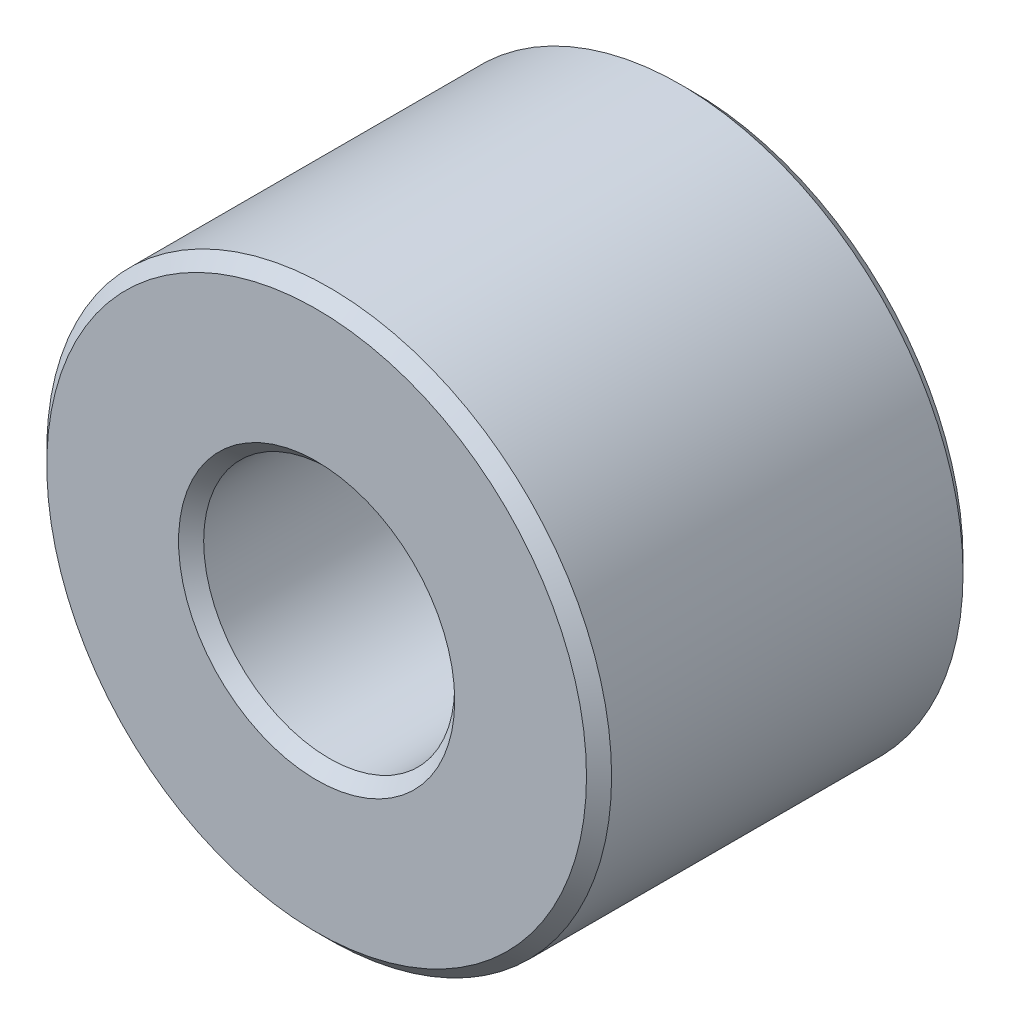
ISO-10303-21;
HEADER;
FILE_DESCRIPTION(('STEP AP214'),'2;1');
FILE_NAME('part.step','',(''),(''),'','','');
FILE_SCHEMA(('AUTOMOTIVE_DESIGN { 1 0 10303 214 1 1 1 1 }'));
ENDSEC;
DATA;
#1=APPLICATION_CONTEXT('core data for automotive mechanical design processes');
#2=APPLICATION_PROTOCOL_DEFINITION('international standard','automotive_design',2000,#1);
#3=PRODUCT_CONTEXT('',#1,'mechanical');
#4=PRODUCT('Part','Part','',(#3));
#5=PRODUCT_RELATED_PRODUCT_CATEGORY('part','',(#4));
#6=PRODUCT_DEFINITION_FORMATION('','',#4);
#7=PRODUCT_DEFINITION_CONTEXT('part definition',#1,'design');
#8=PRODUCT_DEFINITION('design','',#6,#7);
#9=PRODUCT_DEFINITION_SHAPE('','',#8);
#10=(LENGTH_UNIT() NAMED_UNIT(*) SI_UNIT(.MILLI.,.METRE.));
#11=(NAMED_UNIT(*) PLANE_ANGLE_UNIT() SI_UNIT($,.RADIAN.));
#12=(NAMED_UNIT(*) SI_UNIT($,.STERADIAN.) SOLID_ANGLE_UNIT());
#13=UNCERTAINTY_MEASURE_WITH_UNIT(LENGTH_MEASURE(1.E-05),#10,'distance_accuracy_value','');
#14=(GEOMETRIC_REPRESENTATION_CONTEXT(3) GLOBAL_UNCERTAINTY_ASSIGNED_CONTEXT((#13)) GLOBAL_UNIT_ASSIGNED_CONTEXT((#10,
#11,#12)) REPRESENTATION_CONTEXT('',''));
#15=CARTESIAN_POINT('',(0.,0.,0.));
#16=DIRECTION('',(0.,0.,1.));
#17=DIRECTION('',(1.,0.,0.));
#18=AXIS2_PLACEMENT_3D('',#15,#16,#17);
#19=CARTESIAN_POINT('',(0.,0.,15.));
#20=DIRECTION('',(0.,0.,1.));
#21=DIRECTION('',(1.,0.,0.));
#22=AXIS2_PLACEMENT_3D('',#19,#20,#21);
#23=PLANE('',#22);
#24=CARTESIAN_POINT('',(0.,0.,15.));
#25=DIRECTION('',(0.,0.,1.));
#26=DIRECTION('',(1.,0.,0.));
#27=AXIS2_PLACEMENT_3D('',#24,#25,#26);
#28=CIRCLE('',#27,11.);
#29=CARTESIAN_POINT('',(11.,0.,15.));
#30=VERTEX_POINT('',#29);
#31=EDGE_CURVE('E10',#30,#30,#28,.F.);
#32=ORIENTED_EDGE('',*,*,#31,.T.);
#33=EDGE_LOOP('',(#32));
#34=FACE_BOUND('',#33,.T.);
#35=CARTESIAN_POINT('',(0.,0.,15.));
#36=DIRECTION('',(0.,0.,1.));
#37=DIRECTION('',(1.,0.,0.));
#38=AXIS2_PLACEMENT_3D('',#35,#36,#37);
#39=CIRCLE('',#38,21.5);
#40=CARTESIAN_POINT('',(21.5,0.,15.));
#41=VERTEX_POINT('',#40);
#42=EDGE_CURVE('E45',#41,#41,#39,.T.);
#43=ORIENTED_EDGE('',*,*,#42,.T.);
#44=EDGE_LOOP('',(#43));
#45=FACE_BOUND('',#44,.T.);
#46=ADVANCED_FACE('F37',(#34,#45),#23,.T.);
#47=CARTESIAN_POINT('',(0.,0.,-15.));
#48=DIRECTION('',(0.,0.,1.));
#49=DIRECTION('',(1.,0.,0.));
#50=AXIS2_PLACEMENT_3D('',#47,#48,#49);
#51=PLANE('',#50);
#52=CARTESIAN_POINT('',(0.,0.,-15.));
#53=DIRECTION('',(0.,0.,1.));
#54=DIRECTION('',(1.,0.,0.));
#55=AXIS2_PLACEMENT_3D('',#52,#53,#54);
#56=CIRCLE('',#55,11.);
#57=CARTESIAN_POINT('',(11.,0.,-15.));
#58=VERTEX_POINT('',#57);
#59=EDGE_CURVE('E71',#58,#58,#56,.T.);
#60=ORIENTED_EDGE('',*,*,#59,.T.);
#61=EDGE_LOOP('',(#60));
#62=FACE_BOUND('',#61,.T.);
#63=CARTESIAN_POINT('',(0.,0.,-15.));
#64=DIRECTION('',(0.,0.,1.));
#65=DIRECTION('',(1.,0.,0.));
#66=AXIS2_PLACEMENT_3D('',#63,#64,#65);
#67=CIRCLE('',#66,21.5);
#68=CARTESIAN_POINT('',(21.5,0.,-15.));
#69=VERTEX_POINT('',#68);
#70=EDGE_CURVE('E74',#69,#69,#67,.F.);
#71=ORIENTED_EDGE('',*,*,#70,.T.);
#72=EDGE_LOOP('',(#71));
#73=FACE_BOUND('',#72,.T.);
#74=ADVANCED_FACE('F78',(#62,#73),#51,.F.);
#75=CARTESIAN_POINT('',(0.,0.,15.));
#76=DIRECTION('',(0.,0.,-1.));
#77=DIRECTION('',(-1.,0.,0.));
#78=AXIS2_PLACEMENT_3D('',#75,#76,#77);
#79=CYLINDRICAL_SURFACE('',#78,22.5);
#80=CARTESIAN_POINT('',(0.,0.,-14.));
#81=DIRECTION('',(0.,0.,1.));
#82=DIRECTION('',(1.,0.,0.));
#83=AXIS2_PLACEMENT_3D('',#80,#81,#82);
#84=CIRCLE('',#83,22.5);
#85=CARTESIAN_POINT('',(22.5,0.,-14.));
#86=VERTEX_POINT('',#85);
#87=EDGE_CURVE('E52',#86,#86,#84,.T.);
#88=ORIENTED_EDGE('',*,*,#87,.T.);
#89=EDGE_LOOP('',(#88));
#90=FACE_BOUND('',#89,.T.);
#91=CARTESIAN_POINT('',(0.,0.,14.));
#92=DIRECTION('',(0.,0.,1.));
#93=DIRECTION('',(1.,0.,0.));
#94=AXIS2_PLACEMENT_3D('',#91,#92,#93);
#95=CIRCLE('',#94,22.5);
#96=CARTESIAN_POINT('',(22.5,0.,14.));
#97=VERTEX_POINT('',#96);
#98=EDGE_CURVE('E57',#97,#97,#95,.F.);
#99=ORIENTED_EDGE('',*,*,#98,.T.);
#100=EDGE_LOOP('',(#99));
#101=FACE_BOUND('',#100,.T.);
#102=ADVANCED_FACE('F88',(#90,#101),#79,.T.);
#103=CARTESIAN_POINT('',(0.,0.,15.));
#104=DIRECTION('',(0.,0.,-1.));
#105=DIRECTION('',(-1.,0.,0.));
#106=AXIS2_PLACEMENT_3D('',#103,#104,#105);
#107=CYLINDRICAL_SURFACE('',#106,10.);
#108=CARTESIAN_POINT('',(0.,0.,-14.));
#109=DIRECTION('',(0.,0.,1.));
#110=DIRECTION('',(1.,0.,0.));
#111=AXIS2_PLACEMENT_3D('',#108,#109,#110);
#112=CIRCLE('',#111,10.);
#113=CARTESIAN_POINT('',(10.,0.,-14.));
#114=VERTEX_POINT('',#113);
#115=EDGE_CURVE('E63',#114,#114,#112,.F.);
#116=ORIENTED_EDGE('',*,*,#115,.T.);
#117=EDGE_LOOP('',(#116));
#118=FACE_BOUND('',#117,.T.);
#119=CARTESIAN_POINT('',(0.,0.,14.));
#120=DIRECTION('',(0.,0.,1.));
#121=DIRECTION('',(1.,0.,0.));
#122=AXIS2_PLACEMENT_3D('',#119,#120,#121);
#123=CIRCLE('',#122,10.);
#124=CARTESIAN_POINT('',(10.,0.,14.));
#125=VERTEX_POINT('',#124);
#126=EDGE_CURVE('E67',#125,#125,#123,.T.);
#127=ORIENTED_EDGE('',*,*,#126,.T.);
#128=EDGE_LOOP('',(#127));
#129=FACE_BOUND('',#128,.T.);
#130=ADVANCED_FACE('F91',(#118,#129),#107,.F.);
#131=CARTESIAN_POINT('',(0.,0.,-15.));
#132=DIRECTION('',(0.,0.,-1.));
#133=DIRECTION('',(-1.,0.,0.));
#134=AXIS2_PLACEMENT_3D('',#131,#132,#133);
#135=CONICAL_SURFACE('',#134,11.,0.785398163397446);
#136=ORIENTED_EDGE('',*,*,#115,.F.);
#137=EDGE_LOOP('',(#136));
#138=FACE_BOUND('',#137,.T.);
#139=ORIENTED_EDGE('',*,*,#59,.F.);
#140=EDGE_LOOP('',(#139));
#141=FACE_BOUND('',#140,.T.);
#142=ADVANCED_FACE('F84',(#138,#141),#135,.F.);
#143=CARTESIAN_POINT('',(0.,0.,-14.));
#144=DIRECTION('',(0.,0.,1.));
#145=DIRECTION('',(1.,0.,0.));
#146=AXIS2_PLACEMENT_3D('',#143,#144,#145);
#147=CONICAL_SURFACE('',#146,22.5,0.785398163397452);
#148=ORIENTED_EDGE('',*,*,#70,.F.);
#149=EDGE_LOOP('',(#148));
#150=FACE_BOUND('',#149,.T.);
#151=ORIENTED_EDGE('',*,*,#87,.F.);
#152=EDGE_LOOP('',(#151));
#153=FACE_BOUND('',#152,.T.);
#154=ADVANCED_FACE('F80',(#150,#153),#147,.T.);
#155=CARTESIAN_POINT('',(0.,0.,14.));
#156=DIRECTION('',(0.,0.,1.));
#157=DIRECTION('',(1.,0.,0.));
#158=AXIS2_PLACEMENT_3D('',#155,#156,#157);
#159=CONICAL_SURFACE('',#158,10.,0.785398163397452);
#160=ORIENTED_EDGE('',*,*,#31,.F.);
#161=EDGE_LOOP('',(#160));
#162=FACE_BOUND('',#161,.T.);
#163=ORIENTED_EDGE('',*,*,#126,.F.);
#164=EDGE_LOOP('',(#163));
#165=FACE_BOUND('',#164,.T.);
#166=ADVANCED_FACE('F83',(#162,#165),#159,.F.);
#167=CARTESIAN_POINT('',(0.,0.,15.));
#168=DIRECTION('',(0.,0.,-1.));
#169=DIRECTION('',(-1.,0.,0.));
#170=AXIS2_PLACEMENT_3D('',#167,#168,#169);
#171=CONICAL_SURFACE('',#170,21.5,0.785398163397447);
#172=ORIENTED_EDGE('',*,*,#98,.F.);
#173=EDGE_LOOP('',(#172));
#174=FACE_BOUND('',#173,.T.);
#175=ORIENTED_EDGE('',*,*,#42,.F.);
#176=EDGE_LOOP('',(#175));
#177=FACE_BOUND('',#176,.T.);
#178=ADVANCED_FACE('F39',(#174,#177),#171,.T.);
#179=CLOSED_SHELL('',(#46,#74,#102,#130,#142,#154,#166,#178));
#180=MANIFOLD_SOLID_BREP('B2',#179);
#181=ADVANCED_BREP_SHAPE_REPRESENTATION('',(#18,#180),#14);
#182=SHAPE_DEFINITION_REPRESENTATION(#9,#181);
ENDSEC;
END-ISO-10303-21;
